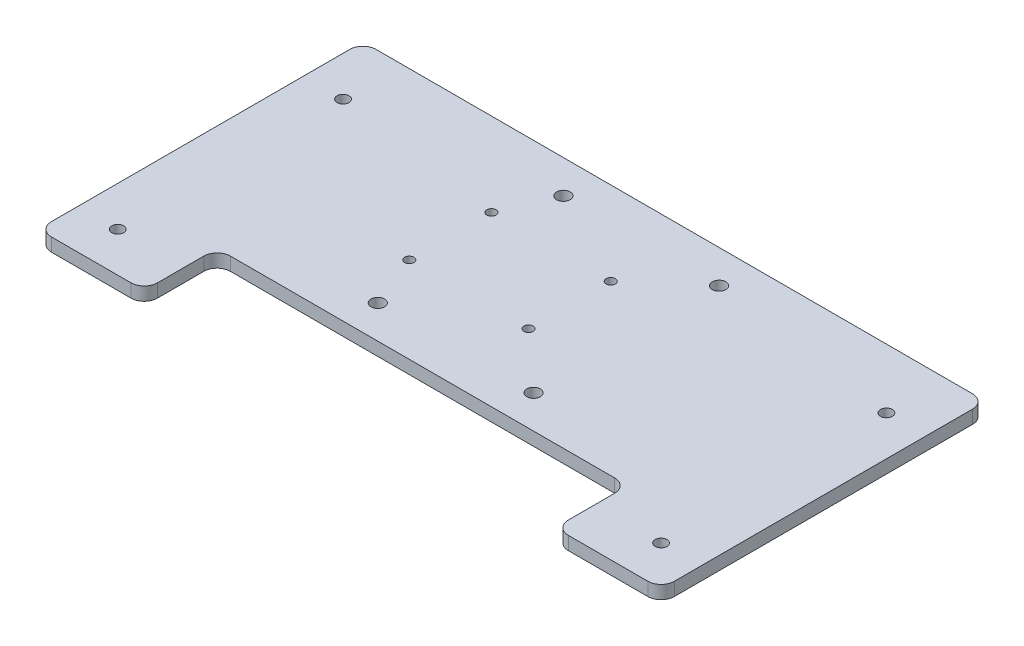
from build123d import *

# Parameters (mm, degrees)
ESQUISSE1_R             = 4.5
ESQUISSE1_R_2           = 3.5
BASE_EXTRUSION_DEPTH    = 10
ESQUISSE2_R             = 5.125
ENL_V_MAT_EXTRU_1_DEPTH = 340.632153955


with BuildPart() as part:
    # Esquisse1 → Base-Extrusion (new body)
    with BuildSketch(Plane(origin=(0, 0, 0), x_dir=(1, 0, 0), z_dir=(0, 1, 0))):
        with BuildLine():
            Line((165, 0), (225, 0))
            ThreePointArc((225, 0), (232.071067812, 2.928932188), (235, 10))
            Line((235, 10), (235, 235))
            ThreePointArc((235, 235), (232.071067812, 242.071067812), (225, 245))
            Line((225, 245), (-225, 245))
            ThreePointArc((-225, 245), (-232.071067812, 242.071067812), (-235, 235))
            Line((-235, 235), (-235, 10))
            ThreePointArc((-235, 10), (-232.071067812, 2.928932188), (-225, 0))
            Line((-225, 0), (-165, 0))
            ThreePointArc((-165, 0), (-157.928932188, 2.928932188), (-155, 10))
            Line((-155, 10), (-155, 45))
            ThreePointArc((-155, 45), (-152.071067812, 52.071067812), (-145, 55))
            Line((-145, 55), (145, 55))
            ThreePointArc((145, 55), (152.071067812, 52.071067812), (155, 45))
            Line((155, 45), (155, 10))
            ThreePointArc((155, 10), (157.928932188, 2.928932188), (165, 0))
        make_face()
        with Locations(Location((205, 200, 0), (0, 0, 270))):
            Circle(ESQUISSE1_R, mode=Mode.SUBTRACT)
        with Locations(Location((205, 30, 0), (0, 0, 270))):
            Circle(ESQUISSE1_R, mode=Mode.SUBTRACT)
        with Locations(Location((-205, 30, 0), (0, 0, 90))):
            Circle(ESQUISSE1_R, mode=Mode.SUBTRACT)
        with Locations(Location((-205, 200, 0), (0, 0, 90))):
            Circle(ESQUISSE1_R, mode=Mode.SUBTRACT)
        with Locations(Location((-75, 182, 0), (0, 0, 270))):
            Circle(ESQUISSE1_R_2, mode=Mode.SUBTRACT)
        with Locations(Location((-75, 120, 0), (0, 0, 270))):
            Circle(ESQUISSE1_R_2, mode=Mode.SUBTRACT)
        with Locations(Location((15, 182, 0), (0, 0, 270))):
            Circle(ESQUISSE1_R_2, mode=Mode.SUBTRACT)
        with Locations(Location((15, 120, 0), (0, 0, 270))):
            Circle(ESQUISSE1_R_2, mode=Mode.SUBTRACT)
    extrude(amount=BASE_EXTRUSION_DEPTH)

    # Esquisse2 → Enl_v. mat.-Extru.1 (cut, through all)
    with BuildSketch(Plane(origin=(0, 10, 0), x_dir=(-1, 0, 0), z_dir=(0, 1, 0))):
        with Locations(Location((58.75, -80, 0), (0, 0, 90))):
            Circle(ESQUISSE2_R)
        with Locations(Location((-58.75, -80, 0), (0, 0, 90))):
            Circle(ESQUISSE2_R)
        with Locations(Location((58.75, -220, 0), (0, 0, 90))):
            Circle(ESQUISSE2_R)
        with Locations(Location((-58.75, -220, 0), (0, 0, 90))):
            Circle(ESQUISSE2_R)
    extrude(amount=-ENL_V_MAT_EXTRU_1_DEPTH, mode=Mode.SUBTRACT)


solid = part.part
